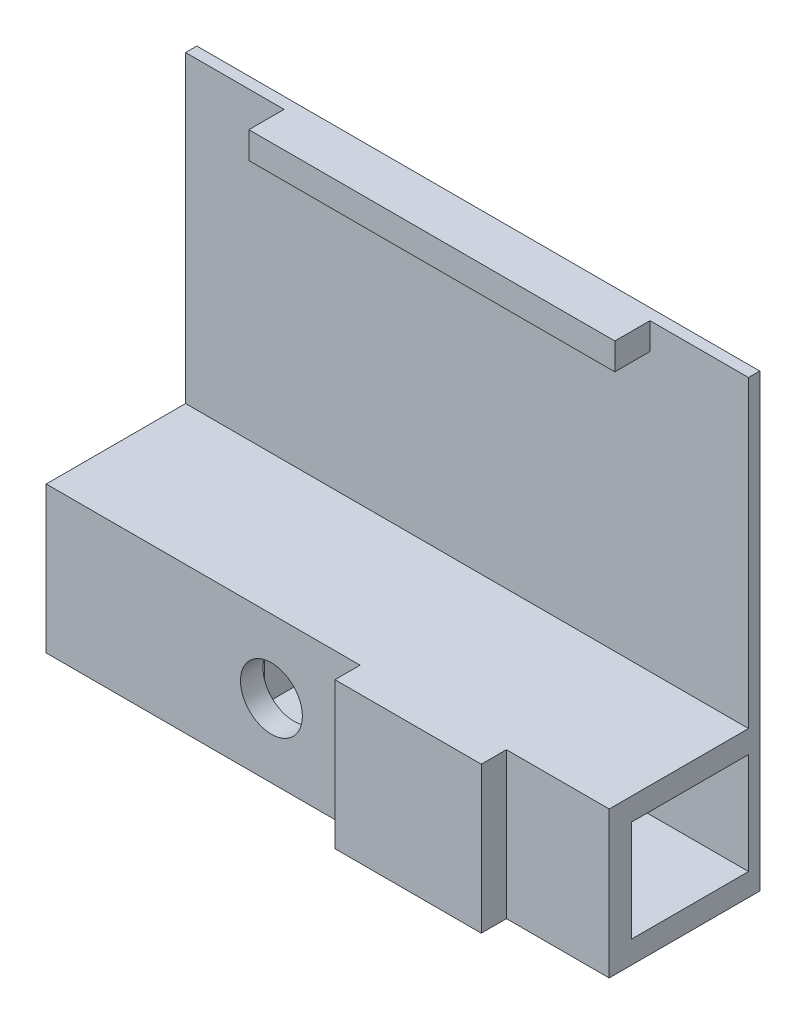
from build123d import *

# Parameters (mm, degrees)
ESQUISSE1_W             = 400
ESQUISSE1_H             = 320
ESQUISSE1_R             = 37.5
EXTRUSION1_DEPTH        = 8
EXTRUSION3_DEPTH        = 240
EXTRUSION3_DEPTH_BACK   = 160
EXTRUSION4_DEPTH        = 110
EXTRUSION4_DEPTH_BACK   = 110
ESQUISSE3_W             = 15
ESQUISSE3_H             = 72
ESQUISSE4_R             = 22
ENL_V_MAT_EXTRU_1_DEPTH = 376.330521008
ESQUISSE5_W             = 16
ESQUISSE5_H             = 44
EXTRUSION5_DEPTH        = 66.5
ESQUISSE6_W             = 104
ESQUISSE6_H             = 104
EXTRUSION6_DEPTH        = 17.87
ESQUISSE7_W             = 260
ESQUISSE7_H             = 19
EXTRUSION7_DEPTH        = 25


with BuildPart() as part:
    # Esquisse1 → Extrusion1 (new body)
    with BuildSketch(Plane.XY):
        with Locations((40, 108)):
            Rectangle(ESQUISSE1_W, ESQUISSE1_H)
        with Locations(Location((0, 0, 0), (0, 0, 253.739795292))):
            Circle(ESQUISSE1_R, mode=Mode.SUBTRACT)
    extrude(amount=EXTRUSION1_DEPTH)

    # Esquisse2 → Extrusion3 (add, two sides: drawn at the far end of the back side and taken through both)
    with BuildSketch(Plane(origin=(0, 0, 0), x_dir=(0, 0, -1), z_dir=(1, 0, 0)).offset(-EXTRUSION3_DEPTH_BACK)):
        Polygon((-8, 52), (-98, 52), (-107, 52), (-107, -52), (-98, -52), (-8, -52), (-8, -36), (-91, -36), (-91, 36), (-8, 36), align=None)
    extrude(amount=EXTRUSION3_DEPTH + EXTRUSION3_DEPTH_BACK)

    # Esquisse3 → Extrusion4 (add, two sides: drawn at the far end of the back side and taken through both)
    with BuildSketch(Plane(origin=(0, 0, 0), x_dir=(0, 0, -1), z_dir=(1, 0, 0)).offset(-EXTRUSION4_DEPTH_BACK)):
        with Locations((-23.5, 0)):
            Rectangle(ESQUISSE3_W, ESQUISSE3_H)
    extrude(amount=EXTRUSION4_DEPTH + EXTRUSION4_DEPTH_BACK)

    # Esquisse4 → Enl_v. mat.-Extru.1 (cut, through all)
    with BuildSketch(Plane.XY.offset(107)):
        with Locations(Location((0, 0, 0), (0, 0, 17.341442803))):
            Circle(ESQUISSE4_R)
    extrude(amount=-ENL_V_MAT_EXTRU_1_DEPTH, mode=Mode.SUBTRACT)

    # Esquisse5 → Extrusion5 (add)
    with BuildSketch(Plane(origin=(0, 0, 91), x_dir=(-1, 0, 0), z_dir=(0, 0, -1))):
        with Locations((29, 0)):
            Rectangle(ESQUISSE5_W, ESQUISSE5_H)
        with Locations((-29, 0)):
            Rectangle(ESQUISSE5_W, ESQUISSE5_H)
    extrude(amount=EXTRUSION5_DEPTH)

    # Esquisse6 → Extrusion6 (add)
    with BuildSketch(Plane.XY.offset(107)):
        with Locations((115, 0)):
            Rectangle(ESQUISSE6_W, ESQUISSE6_H)
    extrude(amount=EXTRUSION6_DEPTH)

    # Esquisse7 → Extrusion7 (add)
    with BuildSketch(Plane.XY.offset(8)):
        with Locations((40, 258.5)):
            Rectangle(ESQUISSE7_W, ESQUISSE7_H)
    extrude(amount=EXTRUSION7_DEPTH)


solid = part.part
